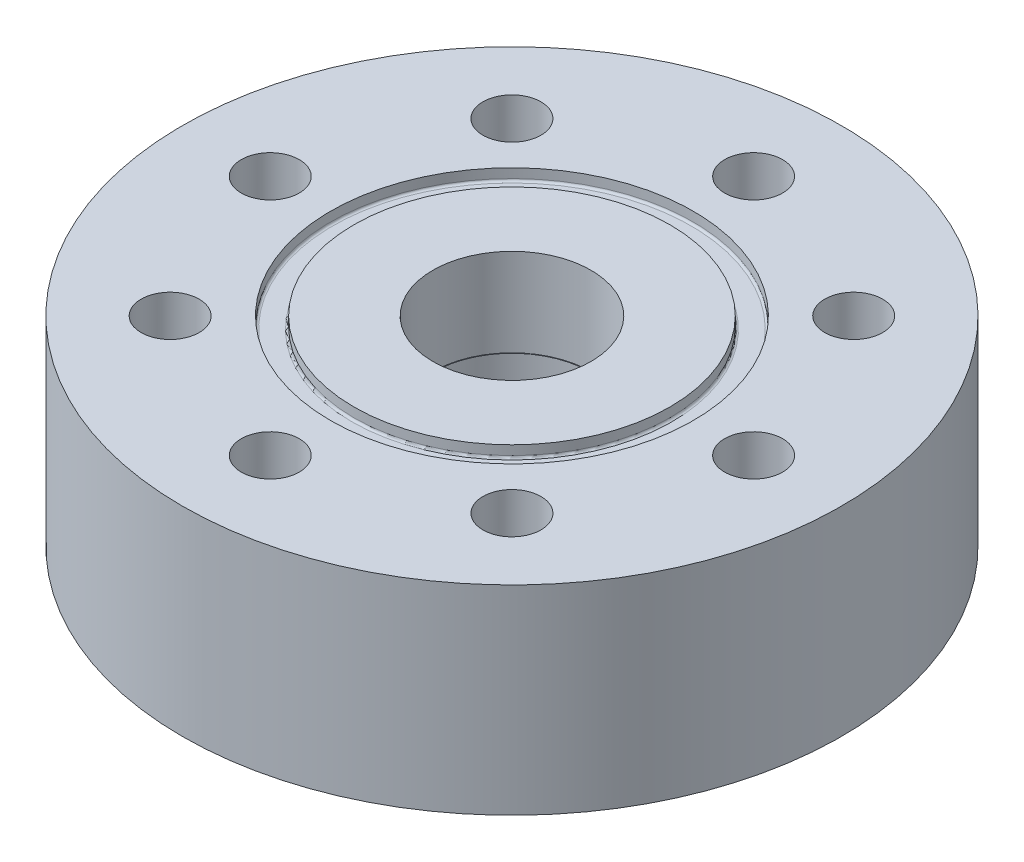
from build123d import *

# Parameters (mm, degrees)
SKETCH2_R                 = 37.5
OUTER_CYLINDER_DEPTH      = 22.7
SKETCH3_R                 = 8.93
NPT_HOLE_DEPTH            = 12.7
SKETCH4_R                 = 3.3
BOLT_HOLES_DEPTH          = 58.687000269
SKETCH5_R                 = 20.6375
SKETCH5_R_2               = 17.9705
O_RING_GROOVE_DEPTH       = 1.3208
FILLET1_R                 = 0.254
SKETCH6_R                 = 9
INLET_FLOW_DIAMETER_DEPTH = 10


with BuildPart() as part:
    # Sketch2 → Outer Cylinder (new body)
    with BuildSketch(Plane(origin=(0, 0, 0), x_dir=(1, 0, 0), z_dir=(0, 1, 0))):
        with Locations(Location((0, 0, 0), (0, 0, 270))):
            Circle(SKETCH2_R)
    extrude(amount=OUTER_CYLINDER_DEPTH)

    # Sketch3 → NPT Hole (cut)
    with BuildSketch(Plane.XZ):
        with Locations(Location((0, 0, 0), (0, 0, 270))):
            Circle(SKETCH3_R)
    extrude(amount=-NPT_HOLE_DEPTH, mode=Mode.SUBTRACT)

    # Sketch4 → Bolt Holes (cut, through all)
    with BuildSketch(Plane.XZ):
        with Locations(Location((-27.5, 0, 0), (0, 0, 270))):
            Circle(SKETCH4_R)
        with Locations(Location((-19.445436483, 19.445436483, 0), (0, 0, 270))):
            Circle(SKETCH4_R)
        with Locations(Location((0, 27.5, 0), (0, 0, 270))):
            Circle(SKETCH4_R)
        with Locations(Location((19.445436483, 19.445436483, 0), (0, 0, 270))):
            Circle(SKETCH4_R)
        with Locations(Location((27.5, 0, 0), (0, 0, 270))):
            Circle(SKETCH4_R)
        with Locations(Location((19.445436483, -19.445436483, 0), (0, 0, 270))):
            Circle(SKETCH4_R)
        with Locations(Location((0, -27.5, 0), (0, 0, 270))):
            Circle(SKETCH4_R)
        with Locations(Location((-19.445436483, -19.445436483, 0), (0, 0, 270))):
            Circle(SKETCH4_R)
    extrude(amount=-BOLT_HOLES_DEPTH, mode=Mode.SUBTRACT)

    # Sketch5 → O-Ring Groove (cut)
    with BuildSketch(Plane(origin=(0, 22.7, 0), x_dir=(1, 0, 0), z_dir=(0, 1, 0))):
        with Locations(Location((0, 0, 0), (0, 0, 270))):
            Circle(SKETCH5_R)
        with Locations(Location((0, 0, 0), (0, 0, 270))):
            Circle(SKETCH5_R_2, mode=Mode.SUBTRACT)
    extrude(amount=-O_RING_GROOVE_DEPTH, mode=Mode.SUBTRACT)

    # Fillet1
    fillet1_edges = [part.edges().sort_by_distance(p)[0] for p in [
        (0, 21.3792, -20.6375),
        (0, 21.3792, -17.9705),
    ]]
    fillet(fillet1_edges, radius=FILLET1_R)

    # Sketch6 → Inlet Flow Diameter (cut)
    with BuildSketch(Plane(origin=(0, 22.7, 0), x_dir=(1, 0, 0), z_dir=(0, 1, 0))):
        with Locations(Location((0, 0, 0), (0, 0, 270))):
            Circle(SKETCH6_R)
    extrude(amount=-INLET_FLOW_DIAMETER_DEPTH, mode=Mode.SUBTRACT)


solid = part.part
